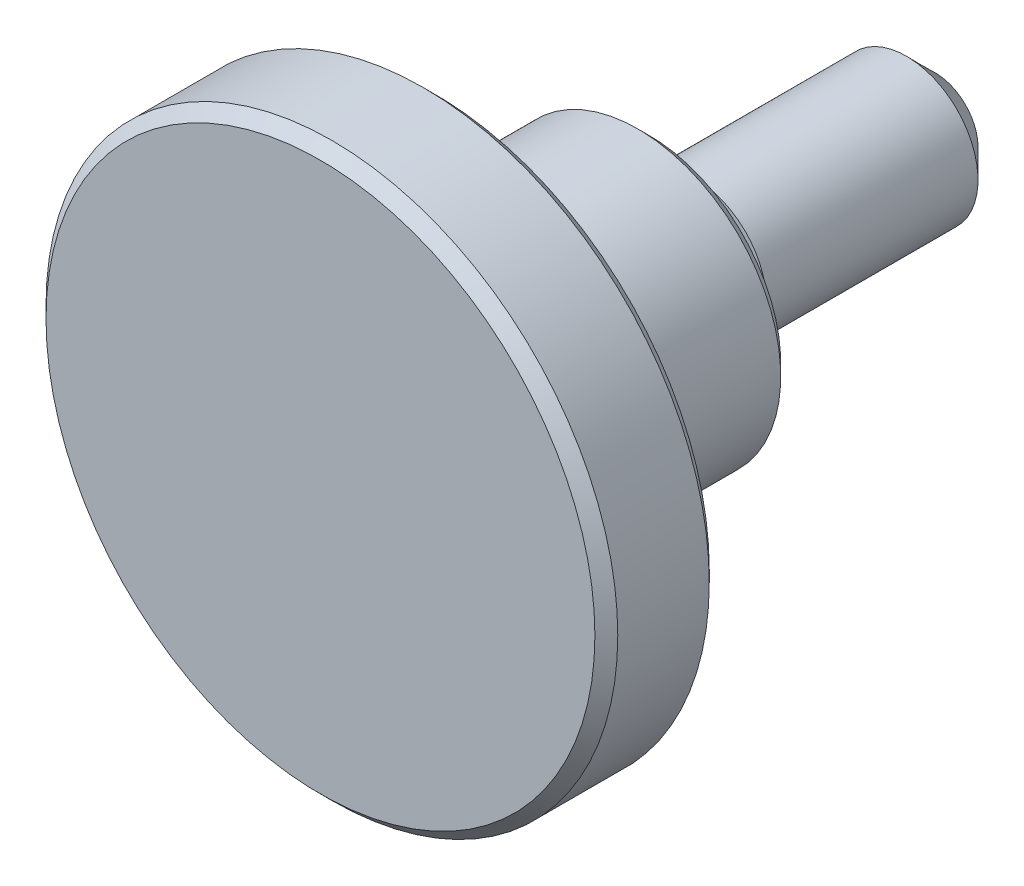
ISO-10303-21;
HEADER;
FILE_DESCRIPTION(('STEP AP214'),'2;1');
FILE_NAME('part.step','',(''),(''),'','','');
FILE_SCHEMA(('AUTOMOTIVE_DESIGN { 1 0 10303 214 1 1 1 1 }'));
ENDSEC;
DATA;
#1=APPLICATION_CONTEXT('core data for automotive mechanical design processes');
#2=APPLICATION_PROTOCOL_DEFINITION('international standard','automotive_design',2000,#1);
#3=PRODUCT_CONTEXT('',#1,'mechanical');
#4=PRODUCT('Part','Part','',(#3));
#5=PRODUCT_RELATED_PRODUCT_CATEGORY('part','',(#4));
#6=PRODUCT_DEFINITION_FORMATION('','',#4);
#7=PRODUCT_DEFINITION_CONTEXT('part definition',#1,'design');
#8=PRODUCT_DEFINITION('design','',#6,#7);
#9=PRODUCT_DEFINITION_SHAPE('','',#8);
#10=(LENGTH_UNIT() NAMED_UNIT(*) SI_UNIT(.MILLI.,.METRE.));
#11=(NAMED_UNIT(*) PLANE_ANGLE_UNIT() SI_UNIT($,.RADIAN.));
#12=(NAMED_UNIT(*) SI_UNIT($,.STERADIAN.) SOLID_ANGLE_UNIT());
#13=UNCERTAINTY_MEASURE_WITH_UNIT(LENGTH_MEASURE(1.E-05),#10,'distance_accuracy_value','');
#14=(GEOMETRIC_REPRESENTATION_CONTEXT(3) GLOBAL_UNCERTAINTY_ASSIGNED_CONTEXT((#13)) GLOBAL_UNIT_ASSIGNED_CONTEXT((#10,
#11,#12)) REPRESENTATION_CONTEXT('',''));
#15=CARTESIAN_POINT('',(0.,0.,0.));
#16=DIRECTION('',(0.,0.,1.));
#17=DIRECTION('',(1.,0.,0.));
#18=AXIS2_PLACEMENT_3D('',#15,#16,#17);
#19=CARTESIAN_POINT('',(0.,1.5,-10.));
#20=DIRECTION('',(0.,0.,-1.));
#21=DIRECTION('',(-1.,0.,0.));
#22=AXIS2_PLACEMENT_3D('',#19,#20,#21);
#23=PLANE('',#22);
#24=CARTESIAN_POINT('',(0.,0.,-10.));
#25=DIRECTION('',(0.,0.,-1.));
#26=DIRECTION('',(-1.,0.,0.));
#27=AXIS2_PLACEMENT_3D('',#24,#25,#26);
#28=CIRCLE('',#27,1.5);
#29=CARTESIAN_POINT('',(-1.5,0.,-10.));
#30=VERTEX_POINT('',#29);
#31=EDGE_CURVE('E8',#30,#30,#28,.T.);
#32=ORIENTED_EDGE('',*,*,#31,.T.);
#33=EDGE_LOOP('',(#32));
#34=FACE_BOUND('',#33,.T.);
#35=ADVANCED_FACE('F12',(#34),#23,.T.);
#36=CARTESIAN_POINT('',(0.,0.,-10.));
#37=DIRECTION('',(0.,0.,1.));
#38=DIRECTION('',(1.,0.,0.));
#39=AXIS2_PLACEMENT_3D('',#36,#37,#38);
#40=CONICAL_SURFACE('',#39,1.5,0.785398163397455);
#41=CARTESIAN_POINT('',(0.,0.,-9.));
#42=DIRECTION('',(0.,0.,-1.));
#43=DIRECTION('',(-1.,0.,0.));
#44=AXIS2_PLACEMENT_3D('',#41,#42,#43);
#45=CIRCLE('',#44,2.5);
#46=CARTESIAN_POINT('',(-2.5,0.,-9.));
#47=VERTEX_POINT('',#46);
#48=EDGE_CURVE('E18',#47,#47,#45,.T.);
#49=ORIENTED_EDGE('',*,*,#48,.T.);
#50=EDGE_LOOP('',(#49));
#51=FACE_BOUND('',#50,.T.);
#52=ORIENTED_EDGE('',*,*,#31,.F.);
#53=EDGE_LOOP('',(#52));
#54=FACE_BOUND('',#53,.T.);
#55=ADVANCED_FACE('F79',(#51,#54),#40,.T.);
#56=CARTESIAN_POINT('',(0.,0.,-12.5));
#57=DIRECTION('',(0.,0.,-1.));
#58=DIRECTION('',(-1.,0.,0.));
#59=AXIS2_PLACEMENT_3D('',#56,#57,#58);
#60=CYLINDRICAL_SURFACE('',#59,2.5);
#61=CARTESIAN_POINT('',(0.,0.,-1.6));
#62=DIRECTION('',(0.,0.,-1.));
#63=DIRECTION('',(-1.,0.,0.));
#64=AXIS2_PLACEMENT_3D('',#61,#62,#63);
#65=CIRCLE('',#64,2.5);
#66=CARTESIAN_POINT('',(-2.5,0.,-1.6));
#67=VERTEX_POINT('',#66);
#68=EDGE_CURVE('E22',#67,#67,#65,.T.);
#69=ORIENTED_EDGE('',*,*,#68,.T.);
#70=EDGE_LOOP('',(#69));
#71=FACE_BOUND('',#70,.T.);
#72=ORIENTED_EDGE('',*,*,#48,.F.);
#73=EDGE_LOOP('',(#72));
#74=FACE_BOUND('',#73,.T.);
#75=ADVANCED_FACE('F84',(#71,#74),#60,.T.);
#76=CARTESIAN_POINT('',(0.,2.25,-1.6));
#77=DIRECTION('',(0.,0.,1.));
#78=DIRECTION('',(1.,0.,0.));
#79=AXIS2_PLACEMENT_3D('',#76,#77,#78);
#80=PLANE('',#79);
#81=CARTESIAN_POINT('',(0.,0.,-1.6));
#82=DIRECTION('',(0.,0.,-1.));
#83=DIRECTION('',(-1.,0.,0.));
#84=AXIS2_PLACEMENT_3D('',#81,#82,#83);
#85=CIRCLE('',#84,2.25);
#86=CARTESIAN_POINT('',(-2.25,0.,-1.6));
#87=VERTEX_POINT('',#86);
#88=EDGE_CURVE('E26',#87,#87,#85,.T.);
#89=ORIENTED_EDGE('',*,*,#88,.T.);
#90=EDGE_LOOP('',(#89));
#91=FACE_BOUND('',#90,.T.);
#92=ORIENTED_EDGE('',*,*,#68,.F.);
#93=EDGE_LOOP('',(#92));
#94=FACE_BOUND('',#93,.T.);
#95=ADVANCED_FACE('F89',(#91,#94),#80,.T.);
#96=CARTESIAN_POINT('',(0.,0.,-1.2));
#97=DIRECTION('',(0.,0.,-1.));
#98=DIRECTION('',(-1.,0.,0.));
#99=AXIS2_PLACEMENT_3D('',#96,#97,#98);
#100=TOROIDAL_SURFACE('',#99,2.25,0.4);
#101=CARTESIAN_POINT('',(0.,0.,-1.2));
#102=DIRECTION('',(0.,0.,-1.));
#103=DIRECTION('',(-1.,0.,0.));
#104=AXIS2_PLACEMENT_3D('',#101,#102,#103);
#105=CIRCLE('',#104,1.85);
#106=CARTESIAN_POINT('',(-1.85,0.,-1.2));
#107=VERTEX_POINT('',#106);
#108=EDGE_CURVE('E31',#107,#107,#105,.T.);
#109=ORIENTED_EDGE('',*,*,#108,.T.);
#110=EDGE_LOOP('',(#109));
#111=FACE_BOUND('',#110,.T.);
#112=ORIENTED_EDGE('',*,*,#88,.F.);
#113=EDGE_LOOP('',(#112));
#114=FACE_BOUND('',#113,.T.);
#115=ADVANCED_FACE('F96',(#111,#114),#100,.F.);
#116=CARTESIAN_POINT('',(0.,0.,-12.5));
#117=DIRECTION('',(0.,0.,-1.));
#118=DIRECTION('',(-1.,0.,0.));
#119=AXIS2_PLACEMENT_3D('',#116,#117,#118);
#120=CYLINDRICAL_SURFACE('',#119,1.85);
#121=CARTESIAN_POINT('',(0.,0.,-0.400000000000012));
#122=DIRECTION('',(0.,0.,-1.));
#123=DIRECTION('',(-1.,0.,0.));
#124=AXIS2_PLACEMENT_3D('',#121,#122,#123);
#125=CIRCLE('',#124,1.85);
#126=CARTESIAN_POINT('',(-1.85,0.,-0.400000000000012));
#127=VERTEX_POINT('',#126);
#128=EDGE_CURVE('E34',#127,#127,#125,.T.);
#129=ORIENTED_EDGE('',*,*,#128,.T.);
#130=EDGE_LOOP('',(#129));
#131=FACE_BOUND('',#130,.T.);
#132=ORIENTED_EDGE('',*,*,#108,.F.);
#133=EDGE_LOOP('',(#132));
#134=FACE_BOUND('',#133,.T.);
#135=ADVANCED_FACE('F100',(#131,#134),#120,.T.);
#136=CARTESIAN_POINT('',(0.,0.,-0.400000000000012));
#137=DIRECTION('',(0.,0.,-1.));
#138=DIRECTION('',(-1.,0.,0.));
#139=AXIS2_PLACEMENT_3D('',#136,#137,#138);
#140=TOROIDAL_SURFACE('',#139,2.25,0.400000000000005);
#141=CARTESIAN_POINT('',(0.,0.,0.));
#142=DIRECTION('',(0.,0.,-1.));
#143=DIRECTION('',(-1.,0.,0.));
#144=AXIS2_PLACEMENT_3D('',#141,#142,#143);
#145=CIRCLE('',#144,2.25);
#146=CARTESIAN_POINT('',(-2.25,0.,0.));
#147=VERTEX_POINT('',#146);
#148=EDGE_CURVE('E37',#147,#147,#145,.T.);
#149=ORIENTED_EDGE('',*,*,#148,.T.);
#150=EDGE_LOOP('',(#149));
#151=FACE_BOUND('',#150,.T.);
#152=ORIENTED_EDGE('',*,*,#128,.F.);
#153=EDGE_LOOP('',(#152));
#154=FACE_BOUND('',#153,.T.);
#155=ADVANCED_FACE('F104',(#151,#154),#140,.F.);
#156=CARTESIAN_POINT('',(0.,4.6,0.));
#157=DIRECTION('',(0.,0.,-1.));
#158=DIRECTION('',(-1.,0.,0.));
#159=AXIS2_PLACEMENT_3D('',#156,#157,#158);
#160=PLANE('',#159);
#161=CARTESIAN_POINT('',(0.,0.,0.));
#162=DIRECTION('',(0.,0.,-1.));
#163=DIRECTION('',(-1.,0.,0.));
#164=AXIS2_PLACEMENT_3D('',#161,#162,#163);
#165=CIRCLE('',#164,4.6);
#166=CARTESIAN_POINT('',(-4.6,0.,0.));
#167=VERTEX_POINT('',#166);
#168=EDGE_CURVE('E40',#167,#167,#165,.T.);
#169=ORIENTED_EDGE('',*,*,#168,.T.);
#170=EDGE_LOOP('',(#169));
#171=FACE_BOUND('',#170,.T.);
#172=ORIENTED_EDGE('',*,*,#148,.F.);
#173=EDGE_LOOP('',(#172));
#174=FACE_BOUND('',#173,.T.);
#175=ADVANCED_FACE('F108',(#171,#174),#160,.T.);
#176=CARTESIAN_POINT('',(0.,0.,0.));
#177=DIRECTION('',(0.,0.,1.));
#178=DIRECTION('',(1.,0.,0.));
#179=AXIS2_PLACEMENT_3D('',#176,#177,#178);
#180=CONICAL_SURFACE('',#179,4.6,0.785398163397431);
#181=CARTESIAN_POINT('',(0.,0.,0.400000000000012));
#182=DIRECTION('',(0.,0.,-1.));
#183=DIRECTION('',(-1.,0.,0.));
#184=AXIS2_PLACEMENT_3D('',#181,#182,#183);
#185=CIRCLE('',#184,5.);
#186=CARTESIAN_POINT('',(-5.,0.,0.400000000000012));
#187=VERTEX_POINT('',#186);
#188=EDGE_CURVE('E43',#187,#187,#185,.T.);
#189=ORIENTED_EDGE('',*,*,#188,.T.);
#190=EDGE_LOOP('',(#189));
#191=FACE_BOUND('',#190,.T.);
#192=ORIENTED_EDGE('',*,*,#168,.F.);
#193=EDGE_LOOP('',(#192));
#194=FACE_BOUND('',#193,.T.);
#195=ADVANCED_FACE('F112',(#191,#194),#180,.T.);
#196=CARTESIAN_POINT('',(0.,0.,-12.5));
#197=DIRECTION('',(0.,0.,-1.));
#198=DIRECTION('',(-1.,0.,0.));
#199=AXIS2_PLACEMENT_3D('',#196,#197,#198);
#200=CYLINDRICAL_SURFACE('',#199,5.);
#201=CARTESIAN_POINT('',(0.,0.,6.5));
#202=DIRECTION('',(0.,0.,-1.));
#203=DIRECTION('',(-1.,0.,0.));
#204=AXIS2_PLACEMENT_3D('',#201,#202,#203);
#205=CIRCLE('',#204,5.);
#206=CARTESIAN_POINT('',(-5.,0.,6.5));
#207=VERTEX_POINT('',#206);
#208=EDGE_CURVE('E46',#207,#207,#205,.T.);
#209=ORIENTED_EDGE('',*,*,#208,.T.);
#210=EDGE_LOOP('',(#209));
#211=FACE_BOUND('',#210,.T.);
#212=ORIENTED_EDGE('',*,*,#188,.F.);
#213=EDGE_LOOP('',(#212));
#214=FACE_BOUND('',#213,.T.);
#215=ADVANCED_FACE('F116',(#211,#214),#200,.T.);
#216=CARTESIAN_POINT('',(0.,0.,6.5));
#217=DIRECTION('',(0.,0.,-1.));
#218=DIRECTION('',(-1.,0.,0.));
#219=AXIS2_PLACEMENT_3D('',#216,#217,#218);
#220=TOROIDAL_SURFACE('',#219,6.,1.);
#221=CARTESIAN_POINT('',(0.,0.,7.5));
#222=DIRECTION('',(0.,0.,-1.));
#223=DIRECTION('',(-1.,0.,0.));
#224=AXIS2_PLACEMENT_3D('',#221,#222,#223);
#225=CIRCLE('',#224,6.);
#226=CARTESIAN_POINT('',(-6.,0.,7.5));
#227=VERTEX_POINT('',#226);
#228=EDGE_CURVE('E49',#227,#227,#225,.T.);
#229=ORIENTED_EDGE('',*,*,#228,.T.);
#230=EDGE_LOOP('',(#229));
#231=FACE_BOUND('',#230,.T.);
#232=ORIENTED_EDGE('',*,*,#208,.F.);
#233=EDGE_LOOP('',(#232));
#234=FACE_BOUND('',#233,.T.);
#235=ADVANCED_FACE('F120',(#231,#234),#220,.F.);
#236=CARTESIAN_POINT('',(0.,9.6,7.5));
#237=DIRECTION('',(0.,0.,-1.));
#238=DIRECTION('',(-1.,0.,0.));
#239=AXIS2_PLACEMENT_3D('',#236,#237,#238);
#240=PLANE('',#239);
#241=CARTESIAN_POINT('',(0.,0.,7.5));
#242=DIRECTION('',(0.,0.,-1.));
#243=DIRECTION('',(-1.,0.,0.));
#244=AXIS2_PLACEMENT_3D('',#241,#242,#243);
#245=CIRCLE('',#244,9.6);
#246=CARTESIAN_POINT('',(-9.6,0.,7.5));
#247=VERTEX_POINT('',#246);
#248=EDGE_CURVE('E52',#247,#247,#245,.T.);
#249=ORIENTED_EDGE('',*,*,#248,.T.);
#250=EDGE_LOOP('',(#249));
#251=FACE_BOUND('',#250,.T.);
#252=ORIENTED_EDGE('',*,*,#228,.F.);
#253=EDGE_LOOP('',(#252));
#254=FACE_BOUND('',#253,.T.);
#255=ADVANCED_FACE('F124',(#251,#254),#240,.T.);
#256=CARTESIAN_POINT('',(0.,0.,7.5));
#257=DIRECTION('',(0.,0.,1.));
#258=DIRECTION('',(1.,0.,0.));
#259=AXIS2_PLACEMENT_3D('',#256,#257,#258);
#260=CONICAL_SURFACE('',#259,9.6,0.785398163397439);
#261=CARTESIAN_POINT('',(0.,0.,7.9));
#262=DIRECTION('',(0.,0.,-1.));
#263=DIRECTION('',(-1.,0.,0.));
#264=AXIS2_PLACEMENT_3D('',#261,#262,#263);
#265=CIRCLE('',#264,10.);
#266=CARTESIAN_POINT('',(-10.,0.,7.9));
#267=VERTEX_POINT('',#266);
#268=EDGE_CURVE('E55',#267,#267,#265,.T.);
#269=ORIENTED_EDGE('',*,*,#268,.T.);
#270=EDGE_LOOP('',(#269));
#271=FACE_BOUND('',#270,.T.);
#272=ORIENTED_EDGE('',*,*,#248,.F.);
#273=EDGE_LOOP('',(#272));
#274=FACE_BOUND('',#273,.T.);
#275=ADVANCED_FACE('F128',(#271,#274),#260,.T.);
#276=CARTESIAN_POINT('',(0.,0.,-12.5));
#277=DIRECTION('',(0.,0.,-1.));
#278=DIRECTION('',(-1.,0.,0.));
#279=AXIS2_PLACEMENT_3D('',#276,#277,#278);
#280=CYLINDRICAL_SURFACE('',#279,10.);
#281=CARTESIAN_POINT('',(0.,0.,11.1));
#282=DIRECTION('',(0.,0.,-1.));
#283=DIRECTION('',(-1.,0.,0.));
#284=AXIS2_PLACEMENT_3D('',#281,#282,#283);
#285=CIRCLE('',#284,10.);
#286=CARTESIAN_POINT('',(-10.,0.,11.1));
#287=VERTEX_POINT('',#286);
#288=EDGE_CURVE('E58',#287,#287,#285,.T.);
#289=ORIENTED_EDGE('',*,*,#288,.T.);
#290=EDGE_LOOP('',(#289));
#291=FACE_BOUND('',#290,.T.);
#292=ORIENTED_EDGE('',*,*,#268,.F.);
#293=EDGE_LOOP('',(#292));
#294=FACE_BOUND('',#293,.T.);
#295=ADVANCED_FACE('F76',(#291,#294),#280,.T.);
#296=CARTESIAN_POINT('',(0.,0.,11.1));
#297=DIRECTION('',(0.,0.,-1.));
#298=DIRECTION('',(-1.,0.,0.));
#299=AXIS2_PLACEMENT_3D('',#296,#297,#298);
#300=CONICAL_SURFACE('',#299,10.,0.785398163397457);
#301=CARTESIAN_POINT('',(0.,0.,11.5));
#302=DIRECTION('',(0.,0.,-1.));
#303=DIRECTION('',(-1.,0.,0.));
#304=AXIS2_PLACEMENT_3D('',#301,#302,#303);
#305=CIRCLE('',#304,9.6);
#306=CARTESIAN_POINT('',(-9.6,0.,11.5));
#307=VERTEX_POINT('',#306);
#308=EDGE_CURVE('E61',#307,#307,#305,.T.);
#309=ORIENTED_EDGE('',*,*,#308,.T.);
#310=EDGE_LOOP('',(#309));
#311=FACE_BOUND('',#310,.T.);
#312=ORIENTED_EDGE('',*,*,#288,.F.);
#313=EDGE_LOOP('',(#312));
#314=FACE_BOUND('',#313,.T.);
#315=ADVANCED_FACE('F65',(#311,#314),#300,.T.);
#316=CARTESIAN_POINT('',(0.,9.6,11.5));
#317=DIRECTION('',(0.,0.,1.));
#318=DIRECTION('',(1.,0.,0.));
#319=AXIS2_PLACEMENT_3D('',#316,#317,#318);
#320=PLANE('',#319);
#321=ORIENTED_EDGE('',*,*,#308,.F.);
#322=EDGE_LOOP('',(#321));
#323=FACE_BOUND('',#322,.T.);
#324=ADVANCED_FACE('F68',(#323),#320,.T.);
#325=CLOSED_SHELL('',(#35,#55,#75,#95,#115,#135,#155,#175,#195,#215,#235,#255,#275,#295,#315,#324));
#326=MANIFOLD_SOLID_BREP('B1',#325);
#327=ADVANCED_BREP_SHAPE_REPRESENTATION('',(#18,#326),#14);
#328=SHAPE_DEFINITION_REPRESENTATION(#9,#327);
ENDSEC;
END-ISO-10303-21;
